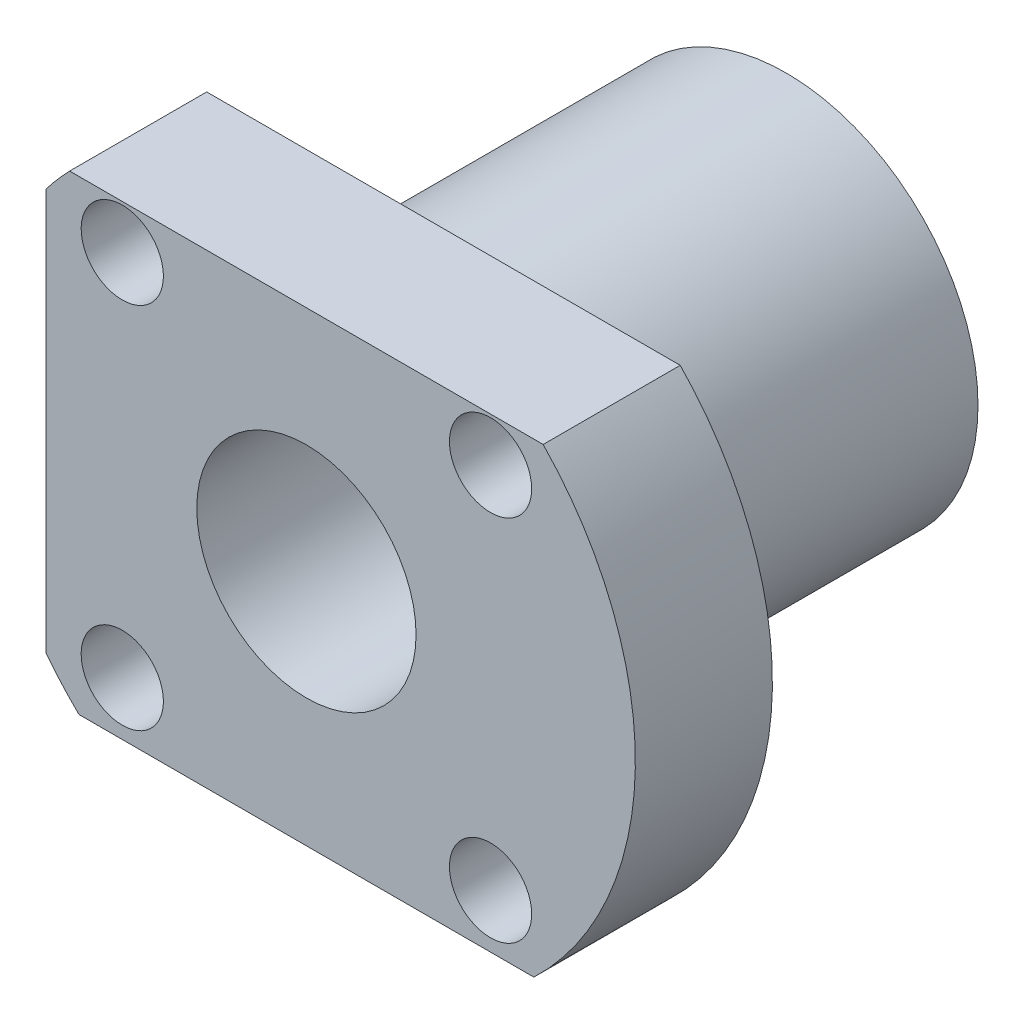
ISO-10303-21;
HEADER;
FILE_DESCRIPTION(('STEP AP214'),'2;1');
FILE_NAME('part.step','',(''),(''),'','','');
FILE_SCHEMA(('AUTOMOTIVE_DESIGN { 1 0 10303 214 1 1 1 1 }'));
ENDSEC;
DATA;
#1=APPLICATION_CONTEXT('core data for automotive mechanical design processes');
#2=APPLICATION_PROTOCOL_DEFINITION('international standard','automotive_design',2000,#1);
#3=PRODUCT_CONTEXT('',#1,'mechanical');
#4=PRODUCT('Part','Part','',(#3));
#5=PRODUCT_RELATED_PRODUCT_CATEGORY('part','',(#4));
#6=PRODUCT_DEFINITION_FORMATION('','',#4);
#7=PRODUCT_DEFINITION_CONTEXT('part definition',#1,'design');
#8=PRODUCT_DEFINITION('design','',#6,#7);
#9=PRODUCT_DEFINITION_SHAPE('','',#8);
#10=(LENGTH_UNIT() NAMED_UNIT(*) SI_UNIT(.MILLI.,.METRE.));
#11=(NAMED_UNIT(*) PLANE_ANGLE_UNIT() SI_UNIT($,.RADIAN.));
#12=(NAMED_UNIT(*) SI_UNIT($,.STERADIAN.) SOLID_ANGLE_UNIT());
#13=UNCERTAINTY_MEASURE_WITH_UNIT(LENGTH_MEASURE(1.E-05),#10,'distance_accuracy_value','');
#14=(GEOMETRIC_REPRESENTATION_CONTEXT(3) GLOBAL_UNCERTAINTY_ASSIGNED_CONTEXT((#13)) GLOBAL_UNIT_ASSIGNED_CONTEXT((#10,
#11,#12)) REPRESENTATION_CONTEXT('',''));
#15=CARTESIAN_POINT('',(0.,0.,0.));
#16=DIRECTION('',(0.,0.,1.));
#17=DIRECTION('',(1.,0.,0.));
#18=AXIS2_PLACEMENT_3D('',#15,#16,#17);
#19=CARTESIAN_POINT('',(-10.,-68.843089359,0.));
#20=DIRECTION('',(0.,0.,1.));
#21=DIRECTION('',(1.,0.,0.));
#22=AXIS2_PLACEMENT_3D('',#19,#20,#21);
#23=PLANE('',#22);
#24=CARTESIAN_POINT('',(9.,-51.503174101,0.));
#25=DIRECTION('',(0.,0.,-1.));
#26=DIRECTION('',(-1.,0.,0.));
#27=AXIS2_PLACEMENT_3D('',#24,#25,#26);
#28=CIRCLE('',#27,8.);
#29=CARTESIAN_POINT('',(1.,-51.503174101,0.));
#30=VERTEX_POINT('',#29);
#31=EDGE_CURVE('E122',#30,#30,#28,.F.);
#32=ORIENTED_EDGE('',*,*,#31,.F.);
#33=EDGE_LOOP('',(#32));
#34=FACE_BOUND('',#33,.T.);
#35=CARTESIAN_POINT('',(22.435028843,-64.938202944,0.));
#36=DIRECTION('',(0.,0.,1.));
#37=DIRECTION('',(0.,-1.,0.));
#38=AXIS2_PLACEMENT_3D('',#35,#36,#37);
#39=CIRCLE('',#38,3.);
#40=CARTESIAN_POINT('',(22.435028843,-67.938202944,0.));
#41=VERTEX_POINT('',#40);
#42=EDGE_CURVE('E134',#41,#41,#39,.T.);
#43=ORIENTED_EDGE('',*,*,#42,.F.);
#44=EDGE_LOOP('',(#43));
#45=FACE_BOUND('',#44,.T.);
#46=CARTESIAN_POINT('',(-4.435028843,-64.938202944,0.));
#47=DIRECTION('',(0.,0.,1.));
#48=DIRECTION('',(0.,-1.,0.));
#49=AXIS2_PLACEMENT_3D('',#46,#47,#48);
#50=CIRCLE('',#49,3.);
#51=CARTESIAN_POINT('',(-4.435028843,-67.938202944,0.));
#52=VERTEX_POINT('',#51);
#53=EDGE_CURVE('E131',#52,#52,#50,.T.);
#54=ORIENTED_EDGE('',*,*,#53,.F.);
#55=EDGE_LOOP('',(#54));
#56=FACE_BOUND('',#55,.T.);
#57=CARTESIAN_POINT('',(-4.435028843,-38.068145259,0.));
#58=DIRECTION('',(0.,0.,1.));
#59=DIRECTION('',(0.,-1.,0.));
#60=AXIS2_PLACEMENT_3D('',#57,#58,#59);
#61=CIRCLE('',#60,3.);
#62=CARTESIAN_POINT('',(-4.435028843,-41.068145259,0.));
#63=VERTEX_POINT('',#62);
#64=EDGE_CURVE('E128',#63,#63,#61,.T.);
#65=ORIENTED_EDGE('',*,*,#64,.F.);
#66=EDGE_LOOP('',(#65));
#67=FACE_BOUND('',#66,.T.);
#68=CARTESIAN_POINT('',(22.435028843,-38.068145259,0.));
#69=DIRECTION('',(0.,0.,1.));
#70=DIRECTION('',(0.,-1.,0.));
#71=AXIS2_PLACEMENT_3D('',#68,#69,#70);
#72=CIRCLE('',#71,3.);
#73=CARTESIAN_POINT('',(22.435028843,-41.068145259,0.));
#74=VERTEX_POINT('',#73);
#75=EDGE_CURVE('E125',#74,#74,#72,.T.);
#76=ORIENTED_EDGE('',*,*,#75,.F.);
#77=EDGE_LOOP('',(#76));
#78=FACE_BOUND('',#77,.T.);
#79=DIRECTION('',(-1.,0.,0.));
#80=VECTOR('',#79,1.);
#81=CARTESIAN_POINT('',(9.,-34.843089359,0.));
#82=LINE('',#81,#80);
#83=CARTESIAN_POINT('',(26.2754616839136,-34.843089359,0.));
#84=VERTEX_POINT('',#83);
#85=CARTESIAN_POINT('',(-8.27546168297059,-34.8430893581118,0.));
#86=VERTEX_POINT('',#85);
#87=EDGE_CURVE('E74',#84,#86,#82,.T.);
#88=ORIENTED_EDGE('',*,*,#87,.T.);
#89=CARTESIAN_POINT('',(9.,-51.503174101,0.));
#90=DIRECTION('',(0.,0.,-1.));
#91=DIRECTION('',(-1.,0.,0.));
#92=AXIS2_PLACEMENT_3D('',#89,#90,#91);
#93=CIRCLE('',#92,24.);
#94=CARTESIAN_POINT('',(-10.,-36.8402958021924,0.));
#95=VERTEX_POINT('',#94);
#96=EDGE_CURVE('E92',#86,#95,#93,.F.);
#97=ORIENTED_EDGE('',*,*,#96,.T.);
#98=DIRECTION('',(0.,-1.,0.));
#99=VECTOR('',#98,1.);
#100=CARTESIAN_POINT('',(-10.,-51.503174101,0.));
#101=LINE('',#100,#99);
#102=CARTESIAN_POINT('',(-10.0000000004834,-66.1660523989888,0.));
#103=VERTEX_POINT('',#102);
#104=EDGE_CURVE('E141',#95,#103,#101,.T.);
#105=ORIENTED_EDGE('',*,*,#104,.T.);
#106=CARTESIAN_POINT('',(9.,-51.503174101,0.));
#107=DIRECTION('',(0.,0.,-1.));
#108=DIRECTION('',(-1.,0.,0.));
#109=AXIS2_PLACEMENT_3D('',#106,#107,#108);
#110=CIRCLE('',#109,24.);
#111=CARTESIAN_POINT('',(-7.59299065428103,-68.8430893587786,0.));
#112=VERTEX_POINT('',#111);
#113=EDGE_CURVE('E137',#103,#112,#110,.F.);
#114=ORIENTED_EDGE('',*,*,#113,.T.);
#115=DIRECTION('',(1.,0.,0.));
#116=VECTOR('',#115,1.);
#117=CARTESIAN_POINT('',(9.,-68.843089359,0.));
#118=LINE('',#117,#116);
#119=CARTESIAN_POINT('',(25.5929906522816,-68.8430893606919,0.));
#120=VERTEX_POINT('',#119);
#121=EDGE_CURVE('E69',#112,#120,#118,.T.);
#122=ORIENTED_EDGE('',*,*,#121,.T.);
#123=CARTESIAN_POINT('',(9.,-51.503174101,0.));
#124=DIRECTION('',(0.,0.,-1.));
#125=DIRECTION('',(-1.,0.,0.));
#126=AXIS2_PLACEMENT_3D('',#123,#124,#125);
#127=CIRCLE('',#126,24.);
#128=EDGE_CURVE('E21',#120,#84,#127,.F.);
#129=ORIENTED_EDGE('',*,*,#128,.T.);
#130=EDGE_LOOP('',(#88,#97,#105,#114,#122,#129));
#131=FACE_BOUND('',#130,.T.);
#132=ADVANCED_FACE('F17',(#34,#45,#56,#67,#78,#131),#23,.T.);
#133=CARTESIAN_POINT('',(-7.592990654,-68.843089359,-10.));
#134=DIRECTION('',(0.,1.,0.));
#135=DIRECTION('',(0.,0.,1.));
#136=AXIS2_PLACEMENT_3D('',#133,#134,#135);
#137=PLANE('',#136);
#138=DIRECTION('',(0.,0.,-1.));
#139=VECTOR('',#138,1.);
#140=CARTESIAN_POINT('',(25.5929906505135,-68.8430893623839,-5.));
#141=LINE('',#140,#139);
#142=CARTESIAN_POINT('',(25.5929906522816,-68.8430893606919,-10.));
#143=VERTEX_POINT('',#142);
#144=EDGE_CURVE('E79',#143,#120,#141,.F.);
#145=ORIENTED_EDGE('',*,*,#144,.T.);
#146=ORIENTED_EDGE('',*,*,#121,.F.);
#147=DIRECTION('',(0.,0.,1.));
#148=VECTOR('',#147,1.);
#149=CARTESIAN_POINT('',(-7.59299065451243,-68.8430893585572,-5.));
#150=LINE('',#149,#148);
#151=CARTESIAN_POINT('',(-7.59299065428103,-68.8430893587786,-10.));
#152=VERTEX_POINT('',#151);
#153=EDGE_CURVE('E145',#112,#152,#150,.F.);
#154=ORIENTED_EDGE('',*,*,#153,.T.);
#155=DIRECTION('',(1.,0.,0.));
#156=VECTOR('',#155,1.);
#157=CARTESIAN_POINT('',(11.629,-68.843089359,-10.));
#158=LINE('',#157,#156);
#159=EDGE_CURVE('E121',#152,#143,#158,.T.);
#160=ORIENTED_EDGE('',*,*,#159,.T.);
#161=EDGE_LOOP('',(#145,#146,#154,#160));
#162=FACE_BOUND('',#161,.T.);
#163=ADVANCED_FACE('F150',(#162),#137,.F.);
#164=CARTESIAN_POINT('',(9.,-51.503174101,0.));
#165=DIRECTION('',(0.,0.,-1.));
#166=DIRECTION('',(-1.,0.,0.));
#167=AXIS2_PLACEMENT_3D('',#164,#165,#166);
#168=CYLINDRICAL_SURFACE('',#167,24.);
#169=DIRECTION('',(0.,0.,1.));
#170=VECTOR('',#169,1.);
#171=CARTESIAN_POINT('',(26.275461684,-34.843089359,-5.));
#172=LINE('',#171,#170);
#173=CARTESIAN_POINT('',(26.2754616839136,-34.843089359,-10.));
#174=VERTEX_POINT('',#173);
#175=EDGE_CURVE('E78',#174,#84,#172,.T.);
#176=ORIENTED_EDGE('',*,*,#175,.T.);
#177=ORIENTED_EDGE('',*,*,#128,.F.);
#178=ORIENTED_EDGE('',*,*,#144,.F.);
#179=CARTESIAN_POINT('',(9.,-51.503174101,-10.));
#180=DIRECTION('',(0.,0.,-1.));
#181=DIRECTION('',(-1.,0.,0.));
#182=AXIS2_PLACEMENT_3D('',#179,#180,#181);
#183=CIRCLE('',#182,24.);
#184=EDGE_CURVE('E83',#143,#174,#183,.F.);
#185=ORIENTED_EDGE('',*,*,#184,.T.);
#186=EDGE_LOOP('',(#176,#177,#178,#185));
#187=FACE_BOUND('',#186,.T.);
#188=ADVANCED_FACE('F81',(#187),#168,.T.);
#189=CARTESIAN_POINT('',(-8.275461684,-34.843089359,-10.));
#190=DIRECTION('',(0.,-1.,0.));
#191=DIRECTION('',(1.,0.,0.));
#192=AXIS2_PLACEMENT_3D('',#189,#190,#191);
#193=PLANE('',#192);
#194=DIRECTION('',(0.,0.,-1.));
#195=VECTOR('',#194,1.);
#196=CARTESIAN_POINT('',(-8.27546168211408,-34.8430893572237,-5.));
#197=LINE('',#196,#195);
#198=CARTESIAN_POINT('',(-8.27546168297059,-34.8430893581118,-10.));
#199=VERTEX_POINT('',#198);
#200=EDGE_CURVE('E89',#199,#86,#197,.F.);
#201=ORIENTED_EDGE('',*,*,#200,.T.);
#202=ORIENTED_EDGE('',*,*,#87,.F.);
#203=ORIENTED_EDGE('',*,*,#175,.F.);
#204=DIRECTION('',(-1.,0.,0.));
#205=VECTOR('',#204,1.);
#206=CARTESIAN_POINT('',(11.629,-34.843089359,-10.));
#207=LINE('',#206,#205);
#208=EDGE_CURVE('E119',#174,#199,#207,.T.);
#209=ORIENTED_EDGE('',*,*,#208,.T.);
#210=EDGE_LOOP('',(#201,#202,#203,#209));
#211=FACE_BOUND('',#210,.T.);
#212=ADVANCED_FACE('F87',(#211),#193,.F.);
#213=CARTESIAN_POINT('',(9.,-51.503174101,0.));
#214=DIRECTION('',(0.,0.,-1.));
#215=DIRECTION('',(-1.,0.,0.));
#216=AXIS2_PLACEMENT_3D('',#213,#214,#215);
#217=CYLINDRICAL_SURFACE('',#216,24.);
#218=DIRECTION('',(0.,0.,1.));
#219=VECTOR('',#218,1.);
#220=CARTESIAN_POINT('',(-10.,-36.840295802,-5.));
#221=LINE('',#220,#219);
#222=CARTESIAN_POINT('',(-10.,-36.8402958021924,-10.));
#223=VERTEX_POINT('',#222);
#224=EDGE_CURVE('E139',#223,#95,#221,.T.);
#225=ORIENTED_EDGE('',*,*,#224,.T.);
#226=ORIENTED_EDGE('',*,*,#96,.F.);
#227=ORIENTED_EDGE('',*,*,#200,.F.);
#228=CARTESIAN_POINT('',(9.,-51.503174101,-10.));
#229=DIRECTION('',(0.,0.,-1.));
#230=DIRECTION('',(-1.,0.,0.));
#231=AXIS2_PLACEMENT_3D('',#228,#229,#230);
#232=CIRCLE('',#231,24.);
#233=EDGE_CURVE('E117',#199,#223,#232,.F.);
#234=ORIENTED_EDGE('',*,*,#233,.T.);
#235=EDGE_LOOP('',(#225,#226,#227,#234));
#236=FACE_BOUND('',#235,.T.);
#237=ADVANCED_FACE('F175',(#236),#217,.T.);
#238=CARTESIAN_POINT('',(-10.,-66.1660524,-10.));
#239=DIRECTION('',(1.,0.,0.));
#240=DIRECTION('',(0.,1.,0.));
#241=AXIS2_PLACEMENT_3D('',#238,#239,#240);
#242=PLANE('',#241);
#243=ORIENTED_EDGE('',*,*,#104,.F.);
#244=ORIENTED_EDGE('',*,*,#224,.F.);
#245=DIRECTION('',(0.,-1.,0.));
#246=VECTOR('',#245,1.);
#247=CARTESIAN_POINT('',(-10.,-51.843089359,-10.));
#248=LINE('',#247,#246);
#249=CARTESIAN_POINT('',(-10.0000000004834,-66.1660523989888,-10.));
#250=VERTEX_POINT('',#249);
#251=EDGE_CURVE('E36',#223,#250,#248,.T.);
#252=ORIENTED_EDGE('',*,*,#251,.T.);
#253=DIRECTION('',(0.,0.,-1.));
#254=VECTOR('',#253,1.);
#255=CARTESIAN_POINT('',(-10.0000000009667,-66.1660523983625,-5.));
#256=LINE('',#255,#254);
#257=EDGE_CURVE('E138',#250,#103,#256,.F.);
#258=ORIENTED_EDGE('',*,*,#257,.T.);
#259=EDGE_LOOP('',(#243,#244,#252,#258));
#260=FACE_BOUND('',#259,.T.);
#261=ADVANCED_FACE('F161',(#260),#242,.F.);
#262=CARTESIAN_POINT('',(9.,-51.503174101,0.));
#263=DIRECTION('',(0.,0.,-1.));
#264=DIRECTION('',(-1.,0.,0.));
#265=AXIS2_PLACEMENT_3D('',#262,#263,#264);
#266=CYLINDRICAL_SURFACE('',#265,24.);
#267=ORIENTED_EDGE('',*,*,#257,.F.);
#268=CARTESIAN_POINT('',(9.,-51.503174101,-10.));
#269=DIRECTION('',(0.,0.,-1.));
#270=DIRECTION('',(-1.,0.,0.));
#271=AXIS2_PLACEMENT_3D('',#268,#269,#270);
#272=CIRCLE('',#271,24.);
#273=EDGE_CURVE('E114',#250,#152,#272,.F.);
#274=ORIENTED_EDGE('',*,*,#273,.T.);
#275=ORIENTED_EDGE('',*,*,#153,.F.);
#276=ORIENTED_EDGE('',*,*,#113,.F.);
#277=EDGE_LOOP('',(#267,#274,#275,#276));
#278=FACE_BOUND('',#277,.T.);
#279=ADVANCED_FACE('F163',(#278),#266,.T.);
#280=CARTESIAN_POINT('',(22.435028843,-64.938202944,-10.));
#281=DIRECTION('',(0.,0.,1.));
#282=DIRECTION('',(0.,-1.,0.));
#283=AXIS2_PLACEMENT_3D('',#280,#281,#282);
#284=CYLINDRICAL_SURFACE('',#283,3.);
#285=CARTESIAN_POINT('',(22.435028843,-64.938202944,-10.));
#286=DIRECTION('',(0.,0.,1.));
#287=DIRECTION('',(0.,-1.,0.));
#288=AXIS2_PLACEMENT_3D('',#285,#286,#287);
#289=CIRCLE('',#288,3.);
#290=CARTESIAN_POINT('',(22.435028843,-67.938202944,-10.));
#291=VERTEX_POINT('',#290);
#292=EDGE_CURVE('E111',#291,#291,#289,.F.);
#293=ORIENTED_EDGE('',*,*,#292,.T.);
#294=EDGE_LOOP('',(#293));
#295=FACE_BOUND('',#294,.T.);
#296=ORIENTED_EDGE('',*,*,#42,.T.);
#297=EDGE_LOOP('',(#296));
#298=FACE_BOUND('',#297,.T.);
#299=ADVANCED_FACE('F165',(#295,#298),#284,.F.);
#300=CARTESIAN_POINT('',(-4.435028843,-64.938202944,-10.));
#301=DIRECTION('',(0.,0.,1.));
#302=DIRECTION('',(0.,-1.,0.));
#303=AXIS2_PLACEMENT_3D('',#300,#301,#302);
#304=CYLINDRICAL_SURFACE('',#303,3.);
#305=CARTESIAN_POINT('',(-4.435028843,-64.938202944,-10.));
#306=DIRECTION('',(0.,0.,1.));
#307=DIRECTION('',(0.,-1.,0.));
#308=AXIS2_PLACEMENT_3D('',#305,#306,#307);
#309=CIRCLE('',#308,3.);
#310=CARTESIAN_POINT('',(-4.435028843,-67.938202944,-10.));
#311=VERTEX_POINT('',#310);
#312=EDGE_CURVE('E108',#311,#311,#309,.F.);
#313=ORIENTED_EDGE('',*,*,#312,.T.);
#314=EDGE_LOOP('',(#313));
#315=FACE_BOUND('',#314,.T.);
#316=ORIENTED_EDGE('',*,*,#53,.T.);
#317=EDGE_LOOP('',(#316));
#318=FACE_BOUND('',#317,.T.);
#319=ADVANCED_FACE('F172',(#315,#318),#304,.F.);
#320=CARTESIAN_POINT('',(-4.435028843,-38.068145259,-10.));
#321=DIRECTION('',(0.,0.,1.));
#322=DIRECTION('',(0.,-1.,0.));
#323=AXIS2_PLACEMENT_3D('',#320,#321,#322);
#324=CYLINDRICAL_SURFACE('',#323,3.);
#325=CARTESIAN_POINT('',(-4.435028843,-38.068145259,-10.));
#326=DIRECTION('',(0.,0.,1.));
#327=DIRECTION('',(0.,-1.,0.));
#328=AXIS2_PLACEMENT_3D('',#325,#326,#327);
#329=CIRCLE('',#328,3.);
#330=CARTESIAN_POINT('',(-4.435028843,-41.068145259,-10.));
#331=VERTEX_POINT('',#330);
#332=EDGE_CURVE('E105',#331,#331,#329,.F.);
#333=ORIENTED_EDGE('',*,*,#332,.T.);
#334=EDGE_LOOP('',(#333));
#335=FACE_BOUND('',#334,.T.);
#336=ORIENTED_EDGE('',*,*,#64,.T.);
#337=EDGE_LOOP('',(#336));
#338=FACE_BOUND('',#337,.T.);
#339=ADVANCED_FACE('F196',(#335,#338),#324,.F.);
#340=CARTESIAN_POINT('',(22.435028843,-38.068145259,-10.));
#341=DIRECTION('',(0.,0.,1.));
#342=DIRECTION('',(0.,-1.,0.));
#343=AXIS2_PLACEMENT_3D('',#340,#341,#342);
#344=CYLINDRICAL_SURFACE('',#343,3.);
#345=CARTESIAN_POINT('',(22.435028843,-38.068145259,-10.));
#346=DIRECTION('',(0.,0.,1.));
#347=DIRECTION('',(0.,-1.,0.));
#348=AXIS2_PLACEMENT_3D('',#345,#346,#347);
#349=CIRCLE('',#348,3.);
#350=CARTESIAN_POINT('',(22.435028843,-41.068145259,-10.));
#351=VERTEX_POINT('',#350);
#352=EDGE_CURVE('E102',#351,#351,#349,.F.);
#353=ORIENTED_EDGE('',*,*,#352,.T.);
#354=EDGE_LOOP('',(#353));
#355=FACE_BOUND('',#354,.T.);
#356=ORIENTED_EDGE('',*,*,#75,.T.);
#357=EDGE_LOOP('',(#356));
#358=FACE_BOUND('',#357,.T.);
#359=ADVANCED_FACE('F192',(#355,#358),#344,.F.);
#360=CARTESIAN_POINT('',(9.,-51.503174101,0.));
#361=DIRECTION('',(0.,0.,-1.));
#362=DIRECTION('',(-1.,0.,0.));
#363=AXIS2_PLACEMENT_3D('',#360,#361,#362);
#364=CYLINDRICAL_SURFACE('',#363,8.);
#365=CARTESIAN_POINT('',(9.,-51.503174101,-35.));
#366=DIRECTION('',(0.,0.,-1.));
#367=DIRECTION('',(-1.,0.,0.));
#368=AXIS2_PLACEMENT_3D('',#365,#366,#367);
#369=CIRCLE('',#368,8.);
#370=CARTESIAN_POINT('',(1.,-51.503174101,-35.));
#371=VERTEX_POINT('',#370);
#372=EDGE_CURVE('E99',#371,#371,#369,.F.);
#373=ORIENTED_EDGE('',*,*,#372,.F.);
#374=EDGE_LOOP('',(#373));
#375=FACE_BOUND('',#374,.T.);
#376=ORIENTED_EDGE('',*,*,#31,.T.);
#377=EDGE_LOOP('',(#376));
#378=FACE_BOUND('',#377,.T.);
#379=ADVANCED_FACE('F189',(#375,#378),#364,.F.);
#380=CARTESIAN_POINT('',(-10.,-68.843089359,-10.));
#381=DIRECTION('',(0.,0.,1.));
#382=DIRECTION('',(1.,0.,0.));
#383=AXIS2_PLACEMENT_3D('',#380,#381,#382);
#384=PLANE('',#383);
#385=CARTESIAN_POINT('',(9.,-51.503174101,-10.));
#386=DIRECTION('',(0.,0.,1.));
#387=DIRECTION('',(1.,0.,0.));
#388=AXIS2_PLACEMENT_3D('',#385,#386,#387);
#389=CIRCLE('',#388,14.);
#390=CARTESIAN_POINT('',(23.,-51.503174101,-10.));
#391=VERTEX_POINT('',#390);
#392=EDGE_CURVE('E27',#391,#391,#389,.T.);
#393=ORIENTED_EDGE('',*,*,#392,.T.);
#394=EDGE_LOOP('',(#393));
#395=FACE_BOUND('',#394,.T.);
#396=ORIENTED_EDGE('',*,*,#352,.F.);
#397=EDGE_LOOP('',(#396));
#398=FACE_BOUND('',#397,.T.);
#399=ORIENTED_EDGE('',*,*,#332,.F.);
#400=EDGE_LOOP('',(#399));
#401=FACE_BOUND('',#400,.T.);
#402=ORIENTED_EDGE('',*,*,#312,.F.);
#403=EDGE_LOOP('',(#402));
#404=FACE_BOUND('',#403,.T.);
#405=ORIENTED_EDGE('',*,*,#292,.F.);
#406=EDGE_LOOP('',(#405));
#407=FACE_BOUND('',#406,.T.);
#408=ORIENTED_EDGE('',*,*,#251,.F.);
#409=ORIENTED_EDGE('',*,*,#233,.F.);
#410=ORIENTED_EDGE('',*,*,#208,.F.);
#411=ORIENTED_EDGE('',*,*,#184,.F.);
#412=ORIENTED_EDGE('',*,*,#159,.F.);
#413=ORIENTED_EDGE('',*,*,#273,.F.);
#414=EDGE_LOOP('',(#408,#409,#410,#411,#412,#413));
#415=FACE_BOUND('',#414,.T.);
#416=ADVANCED_FACE('F153',(#395,#398,#401,#404,#407,#415),#384,.F.);
#417=CARTESIAN_POINT('',(23.168,-65.671174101,-35.));
#418=DIRECTION('',(0.,0.,-1.));
#419=DIRECTION('',(-1.,0.,0.));
#420=AXIS2_PLACEMENT_3D('',#417,#418,#419);
#421=PLANE('',#420);
#422=ORIENTED_EDGE('',*,*,#372,.T.);
#423=EDGE_LOOP('',(#422));
#424=FACE_BOUND('',#423,.T.);
#425=CARTESIAN_POINT('',(9.,-51.503174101,-35.));
#426=DIRECTION('',(0.,0.,1.));
#427=DIRECTION('',(1.,0.,0.));
#428=AXIS2_PLACEMENT_3D('',#425,#426,#427);
#429=CIRCLE('',#428,14.);
#430=CARTESIAN_POINT('',(23.,-51.503174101,-35.));
#431=VERTEX_POINT('',#430);
#432=EDGE_CURVE('E11',#431,#431,#429,.F.);
#433=ORIENTED_EDGE('',*,*,#432,.T.);
#434=EDGE_LOOP('',(#433));
#435=FACE_BOUND('',#434,.T.);
#436=ADVANCED_FACE('F19',(#424,#435),#421,.T.);
#437=CARTESIAN_POINT('',(9.,-51.503174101,-35.));
#438=DIRECTION('',(0.,0.,1.));
#439=DIRECTION('',(1.,0.,0.));
#440=AXIS2_PLACEMENT_3D('',#437,#438,#439);
#441=CYLINDRICAL_SURFACE('',#440,14.);
#442=ORIENTED_EDGE('',*,*,#392,.F.);
#443=EDGE_LOOP('',(#442));
#444=FACE_BOUND('',#443,.T.);
#445=ORIENTED_EDGE('',*,*,#432,.F.);
#446=EDGE_LOOP('',(#445));
#447=FACE_BOUND('',#446,.T.);
#448=ADVANCED_FACE('F178',(#444,#447),#441,.T.);
#449=CLOSED_SHELL('',(#132,#163,#188,#212,#237,#261,#279,#299,#319,#339,#359,#379,#416,#436,#448));
#450=MANIFOLD_SOLID_BREP('B1',#449);
#451=ADVANCED_BREP_SHAPE_REPRESENTATION('',(#18,#450),#14);
#452=SHAPE_DEFINITION_REPRESENTATION(#9,#451);
ENDSEC;
END-ISO-10303-21;
